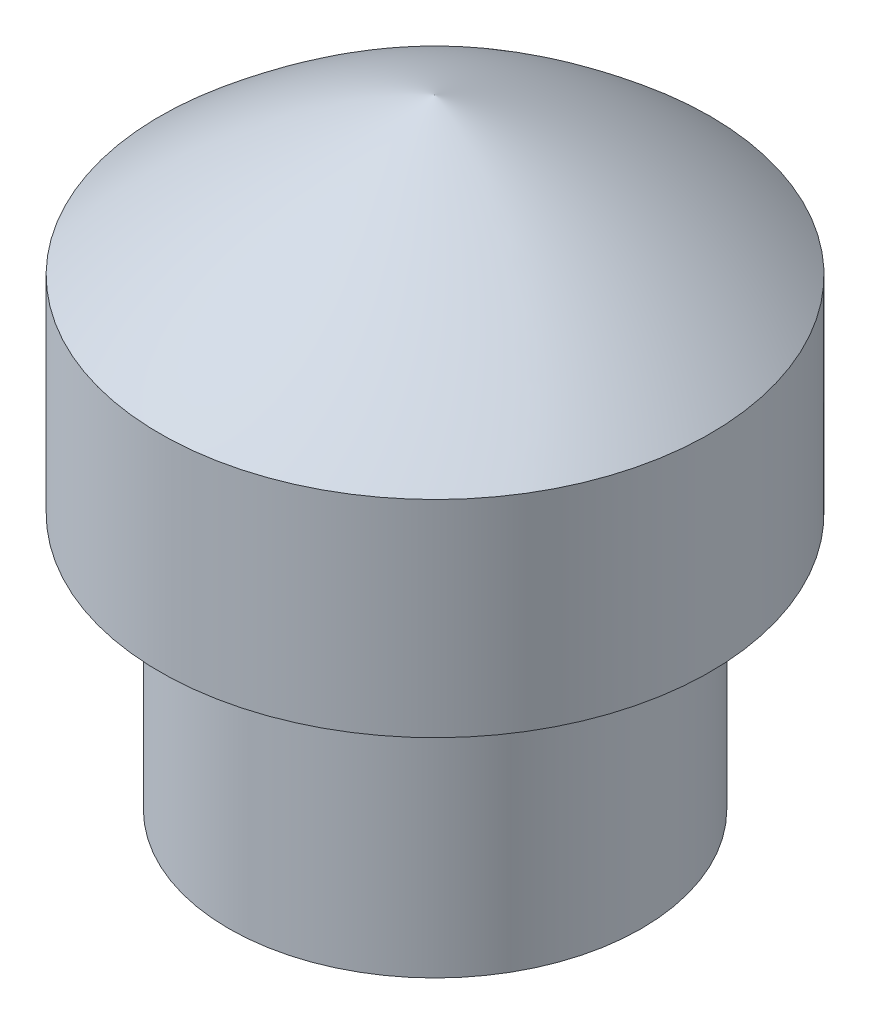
ISO-10303-21;
HEADER;
FILE_DESCRIPTION(('STEP AP214'),'2;1');
FILE_NAME('part.step','',(''),(''),'','','');
FILE_SCHEMA(('AUTOMOTIVE_DESIGN { 1 0 10303 214 1 1 1 1 }'));
ENDSEC;
DATA;
#1=APPLICATION_CONTEXT('core data for automotive mechanical design processes');
#2=APPLICATION_PROTOCOL_DEFINITION('international standard','automotive_design',2000,#1);
#3=PRODUCT_CONTEXT('',#1,'mechanical');
#4=PRODUCT('Part','Part','',(#3));
#5=PRODUCT_RELATED_PRODUCT_CATEGORY('part','',(#4));
#6=PRODUCT_DEFINITION_FORMATION('','',#4);
#7=PRODUCT_DEFINITION_CONTEXT('part definition',#1,'design');
#8=PRODUCT_DEFINITION('design','',#6,#7);
#9=PRODUCT_DEFINITION_SHAPE('','',#8);
#10=(LENGTH_UNIT() NAMED_UNIT(*) SI_UNIT(.MILLI.,.METRE.));
#11=(NAMED_UNIT(*) PLANE_ANGLE_UNIT() SI_UNIT($,.RADIAN.));
#12=(NAMED_UNIT(*) SI_UNIT($,.STERADIAN.) SOLID_ANGLE_UNIT());
#13=UNCERTAINTY_MEASURE_WITH_UNIT(LENGTH_MEASURE(1.E-05),#10,'distance_accuracy_value','');
#14=(GEOMETRIC_REPRESENTATION_CONTEXT(3) GLOBAL_UNCERTAINTY_ASSIGNED_CONTEXT((#13)) GLOBAL_UNIT_ASSIGNED_CONTEXT((#10,
#11,#12)) REPRESENTATION_CONTEXT('',''));
#15=CARTESIAN_POINT('',(0.,0.,0.));
#16=DIRECTION('',(0.,0.,1.));
#17=DIRECTION('',(1.,0.,0.));
#18=AXIS2_PLACEMENT_3D('',#15,#16,#17);
#19=CARTESIAN_POINT('',(0.,-5.64625102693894,8.11509780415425));
#20=DIRECTION('',(-1.,0.,0.));
#21=DIRECTION('',(0.,0.,-1.));
#22=AXIS2_PLACEMENT_3D('',#19,#20,#21);
#23=CIRCLE('',#22,25.);
#24=TRIMMED_CURVE('',#23,(PARAMETER_VALUE(-1.24020339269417)),
(PARAMETER_VALUE(1.24020339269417)),.T.,.PARAMETER.);
#25=CARTESIAN_POINT('',(0.,-5.64625102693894,0.));
#26=DIRECTION('',(0.,-1.,0.));
#27=AXIS1_PLACEMENT('',#25,#26);
#28=SURFACE_OF_REVOLUTION('',#24,#27);
#29=CARTESIAN_POINT('',(0.,18.,0.));
#30=VERTEX_POINT('',#29);
#31=VERTEX_LOOP('',#30);
#32=FACE_BOUND('',#31,.T.);
#33=CARTESIAN_POINT('',(0.,13.4666666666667,0.));
#34=DIRECTION('',(0.,-1.,0.));
#35=DIRECTION('',(0.,0.,-1.));
#36=AXIS2_PLACEMENT_3D('',#33,#34,#35);
#37=CIRCLE('',#36,8.);
#38=CARTESIAN_POINT('',(0.,13.4666666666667,-8.));
#39=VERTEX_POINT('',#38);
#40=EDGE_CURVE('E11',#39,#39,#37,.T.);
#41=ORIENTED_EDGE('',*,*,#40,.F.);
#42=EDGE_LOOP('',(#41));
#43=FACE_BOUND('',#42,.T.);
#44=ADVANCED_FACE('F43',(#32,#43),#28,.T.);
#45=CARTESIAN_POINT('',(0.,0.,0.));
#46=DIRECTION('',(0.,-1.,0.));
#47=DIRECTION('',(0.,0.,-1.));
#48=AXIS2_PLACEMENT_3D('',#45,#46,#47);
#49=CYLINDRICAL_SURFACE('',#48,8.);
#50=ORIENTED_EDGE('',*,*,#40,.T.);
#51=EDGE_LOOP('',(#50));
#52=FACE_BOUND('',#51,.T.);
#53=CARTESIAN_POINT('',(0.,7.46666666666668,0.));
#54=DIRECTION('',(0.,-1.,0.));
#55=DIRECTION('',(0.,0.,-1.));
#56=AXIS2_PLACEMENT_3D('',#53,#54,#55);
#57=CIRCLE('',#56,8.);
#58=CARTESIAN_POINT('',(0.,7.46666666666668,-8.));
#59=VERTEX_POINT('',#58);
#60=EDGE_CURVE('E50',#59,#59,#57,.T.);
#61=ORIENTED_EDGE('',*,*,#60,.F.);
#62=EDGE_LOOP('',(#61));
#63=FACE_BOUND('',#62,.T.);
#64=ADVANCED_FACE('F55',(#52,#63),#49,.T.);
#65=CARTESIAN_POINT('',(6.,7.46666666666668,0.));
#66=DIRECTION('',(0.,-1.,0.));
#67=DIRECTION('',(0.,0.,-1.));
#68=AXIS2_PLACEMENT_3D('',#65,#66,#67);
#69=PLANE('',#68);
#70=ORIENTED_EDGE('',*,*,#60,.T.);
#71=EDGE_LOOP('',(#70));
#72=FACE_BOUND('',#71,.T.);
#73=CARTESIAN_POINT('',(0.,7.46666666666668,0.));
#74=DIRECTION('',(0.,-1.,0.));
#75=DIRECTION('',(0.,0.,-1.));
#76=AXIS2_PLACEMENT_3D('',#73,#74,#75);
#77=CIRCLE('',#76,6.);
#78=CARTESIAN_POINT('',(0.,7.46666666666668,-6.));
#79=VERTEX_POINT('',#78);
#80=EDGE_CURVE('E65',#79,#79,#77,.T.);
#81=ORIENTED_EDGE('',*,*,#80,.F.);
#82=EDGE_LOOP('',(#81));
#83=FACE_BOUND('',#82,.T.);
#84=ADVANCED_FACE('F60',(#72,#83),#69,.T.);
#85=CARTESIAN_POINT('',(0.,0.,0.));
#86=DIRECTION('',(0.,-1.,0.));
#87=DIRECTION('',(0.,0.,-1.));
#88=AXIS2_PLACEMENT_3D('',#85,#86,#87);
#89=CYLINDRICAL_SURFACE('',#88,6.);
#90=ORIENTED_EDGE('',*,*,#80,.T.);
#91=EDGE_LOOP('',(#90));
#92=FACE_BOUND('',#91,.T.);
#93=CARTESIAN_POINT('',(0.,0.,0.));
#94=DIRECTION('',(0.,-1.,0.));
#95=DIRECTION('',(0.,0.,-1.));
#96=AXIS2_PLACEMENT_3D('',#93,#94,#95);
#97=CIRCLE('',#96,6.);
#98=CARTESIAN_POINT('',(0.,0.,-6.));
#99=VERTEX_POINT('',#98);
#100=EDGE_CURVE('E68',#99,#99,#97,.T.);
#101=ORIENTED_EDGE('',*,*,#100,.F.);
#102=EDGE_LOOP('',(#101));
#103=FACE_BOUND('',#102,.T.);
#104=ADVANCED_FACE('F94',(#92,#103),#89,.T.);
#105=CARTESIAN_POINT('',(0.,0.,0.));
#106=DIRECTION('',(0.,-1.,0.));
#107=DIRECTION('',(0.,0.,-1.));
#108=AXIS2_PLACEMENT_3D('',#105,#106,#107);
#109=PLANE('',#108);
#110=CARTESIAN_POINT('',(0.,0.,0.));
#111=DIRECTION('',(0.,-1.,0.));
#112=DIRECTION('',(0.,0.,-1.));
#113=AXIS2_PLACEMENT_3D('',#110,#111,#112);
#114=CIRCLE('',#113,1.5);
#115=CARTESIAN_POINT('',(0.,0.,-1.5));
#116=VERTEX_POINT('',#115);
#117=EDGE_CURVE('E75',#116,#116,#114,.T.);
#118=ORIENTED_EDGE('',*,*,#117,.F.);
#119=EDGE_LOOP('',(#118));
#120=FACE_BOUND('',#119,.T.);
#121=ORIENTED_EDGE('',*,*,#100,.T.);
#122=EDGE_LOOP('',(#121));
#123=FACE_BOUND('',#122,.T.);
#124=ADVANCED_FACE('F88',(#120,#123),#109,.T.);
#125=CARTESIAN_POINT('',(0.,7.,0.));
#126=DIRECTION('',(0.,-1.,0.));
#127=DIRECTION('',(0.,0.,-1.));
#128=AXIS2_PLACEMENT_3D('',#125,#126,#127);
#129=CYLINDRICAL_SURFACE('',#128,1.5);
#130=CARTESIAN_POINT('',(0.,7.,0.));
#131=DIRECTION('',(0.,-1.,0.));
#132=DIRECTION('',(0.,0.,-1.));
#133=AXIS2_PLACEMENT_3D('',#130,#131,#132);
#134=CIRCLE('',#133,1.5);
#135=CARTESIAN_POINT('',(0.,7.,-1.5));
#136=VERTEX_POINT('',#135);
#137=EDGE_CURVE('E74',#136,#136,#134,.T.);
#138=ORIENTED_EDGE('',*,*,#137,.F.);
#139=EDGE_LOOP('',(#138));
#140=FACE_BOUND('',#139,.T.);
#141=ORIENTED_EDGE('',*,*,#117,.T.);
#142=EDGE_LOOP('',(#141));
#143=FACE_BOUND('',#142,.T.);
#144=ADVANCED_FACE('F85',(#140,#143),#129,.F.);
#145=CARTESIAN_POINT('',(0.,7.,0.));
#146=DIRECTION('',(0.,-1.,0.));
#147=DIRECTION('',(0.,0.,-1.));
#148=AXIS2_PLACEMENT_3D('',#145,#146,#147);
#149=PLANE('',#148);
#150=ORIENTED_EDGE('',*,*,#137,.T.);
#151=EDGE_LOOP('',(#150));
#152=FACE_BOUND('',#151,.T.);
#153=ADVANCED_FACE('F83',(#152),#149,.T.);
#154=CLOSED_SHELL('',(#44,#64,#84,#104,#124,#144,#153));
#155=MANIFOLD_SOLID_BREP('B2',#154);
#156=ADVANCED_BREP_SHAPE_REPRESENTATION('',(#18,#155),#14);
#157=SHAPE_DEFINITION_REPRESENTATION(#9,#156);
ENDSEC;
END-ISO-10303-21;
